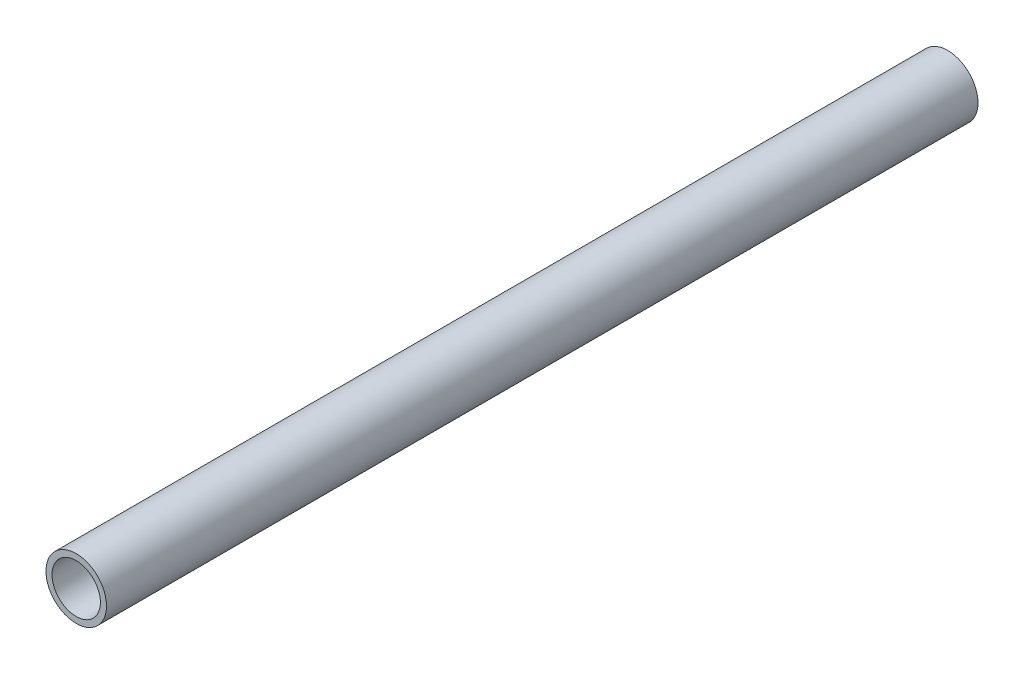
from build123d import *

# Parameters (mm, degrees)
ESQUISSE1_R      = 0.5
ESQUISSE1_R_2    = 0.4
EXTRUSION1_DEPTH = 14.4


with BuildPart() as part:
    # Esquisse1 → Extrusion1 (new body)
    with BuildSketch(Plane.XY):
        Circle(ESQUISSE1_R)
        Circle(ESQUISSE1_R_2, mode=Mode.SUBTRACT)
    extrude(amount=EXTRUSION1_DEPTH)


solid = part.part
